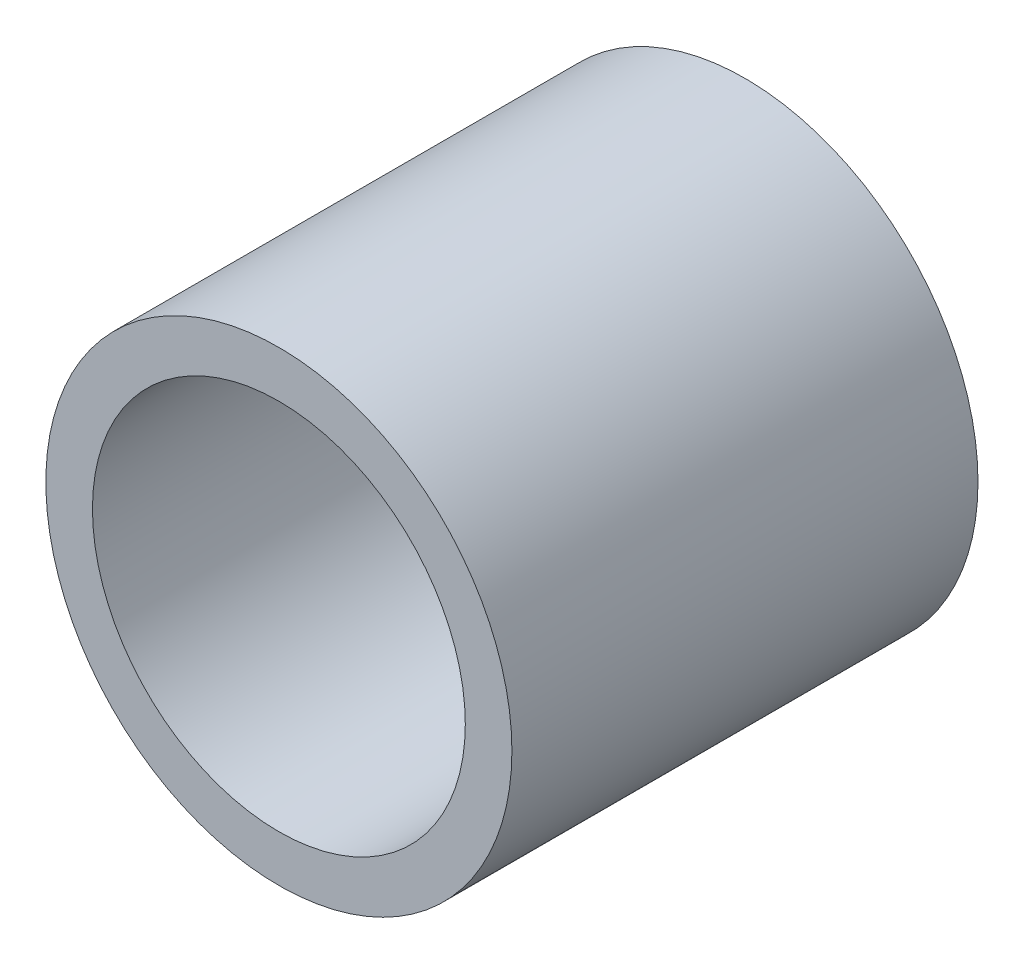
ISO-10303-21;
HEADER;
FILE_DESCRIPTION(('STEP AP214'),'2;1');
FILE_NAME('part.step','',(''),(''),'','','');
FILE_SCHEMA(('AUTOMOTIVE_DESIGN { 1 0 10303 214 1 1 1 1 }'));
ENDSEC;
DATA;
#1=APPLICATION_CONTEXT('core data for automotive mechanical design processes');
#2=APPLICATION_PROTOCOL_DEFINITION('international standard','automotive_design',2000,#1);
#3=PRODUCT_CONTEXT('',#1,'mechanical');
#4=PRODUCT('Part','Part','',(#3));
#5=PRODUCT_RELATED_PRODUCT_CATEGORY('part','',(#4));
#6=PRODUCT_DEFINITION_FORMATION('','',#4);
#7=PRODUCT_DEFINITION_CONTEXT('part definition',#1,'design');
#8=PRODUCT_DEFINITION('design','',#6,#7);
#9=PRODUCT_DEFINITION_SHAPE('','',#8);
#10=(LENGTH_UNIT() NAMED_UNIT(*) SI_UNIT(.MILLI.,.METRE.));
#11=(NAMED_UNIT(*) PLANE_ANGLE_UNIT() SI_UNIT($,.RADIAN.));
#12=(NAMED_UNIT(*) SI_UNIT($,.STERADIAN.) SOLID_ANGLE_UNIT());
#13=UNCERTAINTY_MEASURE_WITH_UNIT(LENGTH_MEASURE(1.E-05),#10,'distance_accuracy_value','');
#14=(GEOMETRIC_REPRESENTATION_CONTEXT(3) GLOBAL_UNCERTAINTY_ASSIGNED_CONTEXT((#13)) GLOBAL_UNIT_ASSIGNED_CONTEXT((#10,
#11,#12)) REPRESENTATION_CONTEXT('',''));
#15=CARTESIAN_POINT('',(0.,0.,0.));
#16=DIRECTION('',(0.,0.,1.));
#17=DIRECTION('',(1.,0.,0.));
#18=AXIS2_PLACEMENT_3D('',#15,#16,#17);
#19=CARTESIAN_POINT('',(0.,0.,40.));
#20=DIRECTION('',(0.,0.,1.));
#21=DIRECTION('',(1.,0.,0.));
#22=AXIS2_PLACEMENT_3D('',#19,#20,#21);
#23=PLANE('',#22);
#24=CARTESIAN_POINT('',(0.,0.,40.));
#25=DIRECTION('',(0.,0.,1.));
#26=DIRECTION('',(1.,0.,0.));
#27=AXIS2_PLACEMENT_3D('',#24,#25,#26);
#28=CIRCLE('',#27,20.);
#29=CARTESIAN_POINT('',(20.,0.,40.));
#30=VERTEX_POINT('',#29);
#31=EDGE_CURVE('E10',#30,#30,#28,.T.);
#32=ORIENTED_EDGE('',*,*,#31,.T.);
#33=EDGE_LOOP('',(#32));
#34=FACE_BOUND('',#33,.T.);
#35=CARTESIAN_POINT('',(0.,0.,40.));
#36=DIRECTION('',(0.,0.,1.));
#37=DIRECTION('',(1.,0.,0.));
#38=AXIS2_PLACEMENT_3D('',#35,#36,#37);
#39=CIRCLE('',#38,16.);
#40=CARTESIAN_POINT('',(16.,0.,40.));
#41=VERTEX_POINT('',#40);
#42=EDGE_CURVE('E43',#41,#41,#39,.T.);
#43=ORIENTED_EDGE('',*,*,#42,.F.);
#44=EDGE_LOOP('',(#43));
#45=FACE_BOUND('',#44,.T.);
#46=ADVANCED_FACE('F32',(#34,#45),#23,.T.);
#47=CARTESIAN_POINT('',(0.,0.,0.));
#48=DIRECTION('',(0.,0.,1.));
#49=DIRECTION('',(1.,0.,0.));
#50=AXIS2_PLACEMENT_3D('',#47,#48,#49);
#51=PLANE('',#50);
#52=CARTESIAN_POINT('',(0.,0.,0.));
#53=DIRECTION('',(0.,0.,1.));
#54=DIRECTION('',(1.,0.,0.));
#55=AXIS2_PLACEMENT_3D('',#52,#53,#54);
#56=CIRCLE('',#55,20.);
#57=CARTESIAN_POINT('',(20.,0.,0.));
#58=VERTEX_POINT('',#57);
#59=EDGE_CURVE('E36',#58,#58,#56,.T.);
#60=ORIENTED_EDGE('',*,*,#59,.F.);
#61=EDGE_LOOP('',(#60));
#62=FACE_BOUND('',#61,.T.);
#63=CARTESIAN_POINT('',(0.,0.,0.));
#64=DIRECTION('',(0.,0.,1.));
#65=DIRECTION('',(1.,0.,0.));
#66=AXIS2_PLACEMENT_3D('',#63,#64,#65);
#67=CIRCLE('',#66,16.);
#68=CARTESIAN_POINT('',(16.,0.,0.));
#69=VERTEX_POINT('',#68);
#70=EDGE_CURVE('E45',#69,#69,#67,.T.);
#71=ORIENTED_EDGE('',*,*,#70,.T.);
#72=EDGE_LOOP('',(#71));
#73=FACE_BOUND('',#72,.T.);
#74=ADVANCED_FACE('F55',(#62,#73),#51,.F.);
#75=CARTESIAN_POINT('',(0.,0.,40.));
#76=DIRECTION('',(0.,0.,-1.));
#77=DIRECTION('',(-1.,0.,0.));
#78=AXIS2_PLACEMENT_3D('',#75,#76,#77);
#79=CYLINDRICAL_SURFACE('',#78,20.);
#80=ORIENTED_EDGE('',*,*,#31,.F.);
#81=EDGE_LOOP('',(#80));
#82=FACE_BOUND('',#81,.T.);
#83=ORIENTED_EDGE('',*,*,#59,.T.);
#84=EDGE_LOOP('',(#83));
#85=FACE_BOUND('',#84,.T.);
#86=ADVANCED_FACE('F34',(#82,#85),#79,.T.);
#87=CARTESIAN_POINT('',(0.,0.,40.));
#88=DIRECTION('',(0.,0.,-1.));
#89=DIRECTION('',(-1.,0.,0.));
#90=AXIS2_PLACEMENT_3D('',#87,#88,#89);
#91=CYLINDRICAL_SURFACE('',#90,16.);
#92=ORIENTED_EDGE('',*,*,#42,.T.);
#93=EDGE_LOOP('',(#92));
#94=FACE_BOUND('',#93,.T.);
#95=ORIENTED_EDGE('',*,*,#70,.F.);
#96=EDGE_LOOP('',(#95));
#97=FACE_BOUND('',#96,.T.);
#98=ADVANCED_FACE('F51',(#94,#97),#91,.F.);
#99=CLOSED_SHELL('',(#46,#74,#86,#98));
#100=MANIFOLD_SOLID_BREP('B2',#99);
#101=ADVANCED_BREP_SHAPE_REPRESENTATION('',(#18,#100),#14);
#102=SHAPE_DEFINITION_REPRESENTATION(#9,#101);
ENDSEC;
END-ISO-10303-21;
